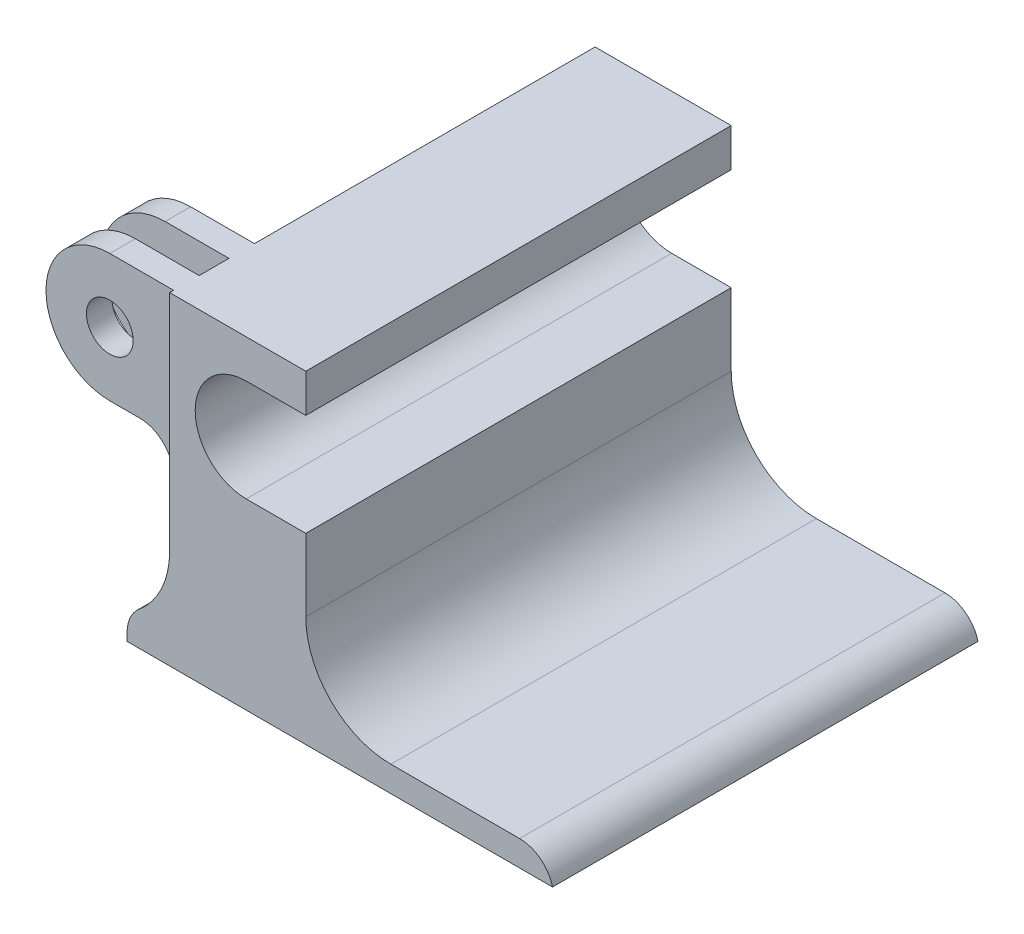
ISO-10303-21;
HEADER;
FILE_DESCRIPTION(('STEP AP214'),'2;1');
FILE_NAME('part.step','',(''),(''),'','','');
FILE_SCHEMA(('AUTOMOTIVE_DESIGN { 1 0 10303 214 1 1 1 1 }'));
ENDSEC;
DATA;
#1=APPLICATION_CONTEXT('core data for automotive mechanical design processes');
#2=APPLICATION_PROTOCOL_DEFINITION('international standard','automotive_design',2000,#1);
#3=PRODUCT_CONTEXT('',#1,'mechanical');
#4=PRODUCT('Part','Part','',(#3));
#5=PRODUCT_RELATED_PRODUCT_CATEGORY('part','',(#4));
#6=PRODUCT_DEFINITION_FORMATION('','',#4);
#7=PRODUCT_DEFINITION_CONTEXT('part definition',#1,'design');
#8=PRODUCT_DEFINITION('design','',#6,#7);
#9=PRODUCT_DEFINITION_SHAPE('','',#8);
#10=(LENGTH_UNIT() NAMED_UNIT(*) SI_UNIT(.MILLI.,.METRE.));
#11=(NAMED_UNIT(*) PLANE_ANGLE_UNIT() SI_UNIT($,.RADIAN.));
#12=(NAMED_UNIT(*) SI_UNIT($,.STERADIAN.) SOLID_ANGLE_UNIT());
#13=UNCERTAINTY_MEASURE_WITH_UNIT(LENGTH_MEASURE(1.E-05),#10,'distance_accuracy_value','');
#14=(GEOMETRIC_REPRESENTATION_CONTEXT(3) GLOBAL_UNCERTAINTY_ASSIGNED_CONTEXT((#13)) GLOBAL_UNIT_ASSIGNED_CONTEXT((#10,
#11,#12)) REPRESENTATION_CONTEXT('',''));
#15=CARTESIAN_POINT('',(0.,0.,0.));
#16=DIRECTION('',(0.,0.,1.));
#17=DIRECTION('',(1.,0.,0.));
#18=AXIS2_PLACEMENT_3D('',#15,#16,#17);
#19=CARTESIAN_POINT('',(-20.,38.,-24.780701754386));
#20=DIRECTION('',(1.,0.,0.));
#21=DIRECTION('',(0.,0.,-1.));
#22=AXIS2_PLACEMENT_3D('',#19,#20,#21);
#23=PLANE('',#22);
#24=DIRECTION('',(0.,-1.,0.));
#25=VECTOR('',#24,1.);
#26=CARTESIAN_POINT('',(-20.,38.,-24.780701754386));
#27=LINE('',#26,#25);
#28=CARTESIAN_POINT('',(-20.,38.,-24.780701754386));
#29=VERTEX_POINT('',#28);
#30=CARTESIAN_POINT('',(-20.,11.6602540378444,-24.780701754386));
#31=VERTEX_POINT('',#30);
#32=EDGE_CURVE('E247',#29,#31,#27,.T.);
#33=ORIENTED_EDGE('',*,*,#32,.T.);
#34=DIRECTION('',(0.,0.,-1.));
#35=VECTOR('',#34,1.);
#36=CARTESIAN_POINT('',(-20.,11.6602540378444,-24.780701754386));
#37=LINE('',#36,#35);
#38=CARTESIAN_POINT('',(-20.,11.6602540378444,25.2192982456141));
#39=VERTEX_POINT('',#38);
#40=EDGE_CURVE('E338',#31,#39,#37,.F.);
#41=ORIENTED_EDGE('',*,*,#40,.T.);
#42=DIRECTION('',(0.,-1.,0.));
#43=VECTOR('',#42,1.);
#44=CARTESIAN_POINT('',(-20.,38.,25.2192982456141));
#45=LINE('',#44,#43);
#46=CARTESIAN_POINT('',(-20.,38.,25.2192982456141));
#47=VERTEX_POINT('',#46);
#48=EDGE_CURVE('E257',#47,#39,#45,.T.);
#49=ORIENTED_EDGE('',*,*,#48,.F.);
#50=DIRECTION('',(0.,0.,1.));
#51=VECTOR('',#50,1.);
#52=CARTESIAN_POINT('',(-20.,38.,-24.780701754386));
#53=LINE('',#52,#51);
#54=CARTESIAN_POINT('',(-20.,38.,24.75));
#55=VERTEX_POINT('',#54);
#56=EDGE_CURVE('E233',#55,#47,#53,.T.);
#57=ORIENTED_EDGE('',*,*,#56,.F.);
#58=DIRECTION('',(0.,1.,0.));
#59=VECTOR('',#58,1.);
#60=CARTESIAN_POINT('',(-20.,38.,24.75));
#61=LINE('',#60,#59);
#62=CARTESIAN_POINT('',(-20.,19.,24.75));
#63=VERTEX_POINT('',#62);
#64=EDGE_CURVE('E216',#63,#55,#61,.T.);
#65=ORIENTED_EDGE('',*,*,#64,.F.);
#66=DIRECTION('',(0.,0.,1.));
#67=VECTOR('',#66,1.);
#68=CARTESIAN_POINT('',(-20.,19.,21.75));
#69=LINE('',#68,#67);
#70=CARTESIAN_POINT('',(-20.,19.,21.75));
#71=VERTEX_POINT('',#70);
#72=EDGE_CURVE('E223',#63,#71,#69,.F.);
#73=ORIENTED_EDGE('',*,*,#72,.T.);
#74=DIRECTION('',(0.,-1.,0.));
#75=VECTOR('',#74,1.);
#76=CARTESIAN_POINT('',(-20.,38.,21.75));
#77=LINE('',#76,#75);
#78=CARTESIAN_POINT('',(-20.,38.,21.75));
#79=VERTEX_POINT('',#78);
#80=EDGE_CURVE('E208',#79,#71,#77,.T.);
#81=ORIENTED_EDGE('',*,*,#80,.F.);
#82=CARTESIAN_POINT('',(-20.,38.,18.25));
#83=VERTEX_POINT('',#82);
#84=EDGE_CURVE('E221',#83,#79,#53,.T.);
#85=ORIENTED_EDGE('',*,*,#84,.F.);
#86=DIRECTION('',(0.,1.,0.));
#87=VECTOR('',#86,1.);
#88=CARTESIAN_POINT('',(-20.,38.,18.25));
#89=LINE('',#88,#87);
#90=CARTESIAN_POINT('',(-20.,19.,18.25));
#91=VERTEX_POINT('',#90);
#92=EDGE_CURVE('E514',#91,#83,#89,.T.);
#93=ORIENTED_EDGE('',*,*,#92,.F.);
#94=DIRECTION('',(0.,0.,1.));
#95=VECTOR('',#94,1.);
#96=CARTESIAN_POINT('',(-20.,19.,15.25));
#97=LINE('',#96,#95);
#98=CARTESIAN_POINT('',(-20.,19.,15.25));
#99=VERTEX_POINT('',#98);
#100=EDGE_CURVE('E311',#91,#99,#97,.F.);
#101=ORIENTED_EDGE('',*,*,#100,.T.);
#102=DIRECTION('',(0.,-1.,0.));
#103=VECTOR('',#102,1.);
#104=CARTESIAN_POINT('',(-20.,38.,15.25));
#105=LINE('',#104,#103);
#106=CARTESIAN_POINT('',(-20.,38.,15.25));
#107=VERTEX_POINT('',#106);
#108=EDGE_CURVE('E512',#107,#99,#105,.T.);
#109=ORIENTED_EDGE('',*,*,#108,.F.);
#110=EDGE_CURVE('E232',#29,#107,#53,.T.);
#111=ORIENTED_EDGE('',*,*,#110,.F.);
#112=EDGE_LOOP('',(#33,#41,#49,#57,#65,#73,#81,#85,#93,#101,#109,#111));
#113=FACE_BOUND('',#112,.T.);
#114=ADVANCED_FACE('F33',(#113),#23,.F.);
#115=CARTESIAN_POINT('',(-4.,38.,-24.780701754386));
#116=DIRECTION('',(-1.,0.,0.));
#117=DIRECTION('',(0.,0.,1.));
#118=AXIS2_PLACEMENT_3D('',#115,#116,#117);
#119=PLANE('',#118);
#120=DIRECTION('',(0.,-1.,0.));
#121=VECTOR('',#120,1.);
#122=CARTESIAN_POINT('',(-3.99999999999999,38.,25.2192982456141));
#123=LINE('',#122,#121);
#124=CARTESIAN_POINT('',(-3.99999999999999,38.,25.2192982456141));
#125=VERTEX_POINT('',#124);
#126=CARTESIAN_POINT('',(-3.99999999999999,33.5,25.2192982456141));
#127=VERTEX_POINT('',#126);
#128=EDGE_CURVE('E254',#125,#127,#123,.T.);
#129=ORIENTED_EDGE('',*,*,#128,.T.);
#130=DIRECTION('',(0.,0.,-1.));
#131=VECTOR('',#130,1.);
#132=CARTESIAN_POINT('',(-4.,33.5,-24.780701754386));
#133=LINE('',#132,#131);
#134=CARTESIAN_POINT('',(-4.,33.5,-24.780701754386));
#135=VERTEX_POINT('',#134);
#136=EDGE_CURVE('E405',#127,#135,#133,.T.);
#137=ORIENTED_EDGE('',*,*,#136,.T.);
#138=DIRECTION('',(0.,-1.,0.));
#139=VECTOR('',#138,1.);
#140=CARTESIAN_POINT('',(-4.,38.,-24.780701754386));
#141=LINE('',#140,#139);
#142=CARTESIAN_POINT('',(-4.,38.,-24.780701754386));
#143=VERTEX_POINT('',#142);
#144=EDGE_CURVE('E250',#143,#135,#141,.T.);
#145=ORIENTED_EDGE('',*,*,#144,.F.);
#146=DIRECTION('',(0.,0.,-1.));
#147=VECTOR('',#146,1.);
#148=CARTESIAN_POINT('',(-4.,38.,-24.780701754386));
#149=LINE('',#148,#147);
#150=EDGE_CURVE('E243',#125,#143,#149,.T.);
#151=ORIENTED_EDGE('',*,*,#150,.F.);
#152=EDGE_LOOP('',(#129,#137,#145,#151));
#153=FACE_BOUND('',#152,.T.);
#154=ADVANCED_FACE('F429',(#153),#119,.F.);
#155=CARTESIAN_POINT('',(-25.,3.,-24.7807017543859));
#156=DIRECTION('',(1.,0.,0.));
#157=DIRECTION('',(0.,0.,-1.));
#158=AXIS2_PLACEMENT_3D('',#155,#156,#157);
#159=PLANE('',#158);
#160=DIRECTION('',(0.,-1.,0.));
#161=VECTOR('',#160,1.);
#162=CARTESIAN_POINT('',(-25.,3.,25.2192982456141));
#163=LINE('',#162,#161);
#164=CARTESIAN_POINT('',(-25.,0.936448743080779,25.2192982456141));
#165=VERTEX_POINT('',#164);
#166=CARTESIAN_POINT('',(-25.,0.,25.2192982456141));
#167=VERTEX_POINT('',#166);
#168=EDGE_CURVE('E276',#165,#167,#163,.T.);
#169=ORIENTED_EDGE('',*,*,#168,.F.);
#170=DIRECTION('',(0.,0.,-1.));
#171=VECTOR('',#170,1.);
#172=CARTESIAN_POINT('',(-25.,0.936448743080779,-24.7807017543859));
#173=LINE('',#172,#171);
#174=CARTESIAN_POINT('',(-25.,0.936448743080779,-24.7807017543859));
#175=VERTEX_POINT('',#174);
#176=EDGE_CURVE('E351',#165,#175,#173,.T.);
#177=ORIENTED_EDGE('',*,*,#176,.T.);
#178=DIRECTION('',(0.,-1.,0.));
#179=VECTOR('',#178,1.);
#180=CARTESIAN_POINT('',(-25.,3.,-24.7807017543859));
#181=LINE('',#180,#179);
#182=CARTESIAN_POINT('',(-25.,0.,-24.7807017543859));
#183=VERTEX_POINT('',#182);
#184=EDGE_CURVE('E266',#175,#183,#181,.T.);
#185=ORIENTED_EDGE('',*,*,#184,.T.);
#186=DIRECTION('',(0.,0.,1.));
#187=VECTOR('',#186,1.);
#188=CARTESIAN_POINT('',(-25.,0.,-24.7807017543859));
#189=LINE('',#188,#187);
#190=EDGE_CURVE('E260',#183,#167,#189,.T.);
#191=ORIENTED_EDGE('',*,*,#190,.T.);
#192=EDGE_LOOP('',(#169,#177,#185,#191));
#193=FACE_BOUND('',#192,.T.);
#194=ADVANCED_FACE('F434',(#193),#159,.F.);
#195=CARTESIAN_POINT('',(-25.,3.,25.2192982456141));
#196=DIRECTION('',(0.,0.,-1.));
#197=DIRECTION('',(-1.,0.,0.));
#198=AXIS2_PLACEMENT_3D('',#195,#196,#197);
#199=PLANE('',#198);
#200=DIRECTION('',(1.,0.,0.));
#201=VECTOR('',#200,1.);
#202=CARTESIAN_POINT('',(-25.,0.,25.2192982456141));
#203=LINE('',#202,#201);
#204=CARTESIAN_POINT('',(25.,0.,25.219298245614));
#205=VERTEX_POINT('',#204);
#206=EDGE_CURVE('E269',#167,#205,#203,.T.);
#207=ORIENTED_EDGE('',*,*,#206,.T.);
#208=CARTESIAN_POINT('',(21.1270166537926,-1.,25.219298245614));
#209=DIRECTION('',(0.,0.,-1.));
#210=DIRECTION('',(-1.,0.,0.));
#211=AXIS2_PLACEMENT_3D('',#208,#209,#210);
#212=CIRCLE('',#211,4.);
#213=CARTESIAN_POINT('',(21.1270166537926,3.,25.219298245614));
#214=VERTEX_POINT('',#213);
#215=EDGE_CURVE('E11',#205,#214,#212,.F.);
#216=ORIENTED_EDGE('',*,*,#215,.T.);
#217=DIRECTION('',(1.,0.,0.));
#218=VECTOR('',#217,1.);
#219=CARTESIAN_POINT('',(-25.,3.,25.2192982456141));
#220=LINE('',#219,#218);
#221=CARTESIAN_POINT('',(6.,3.,25.2192982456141));
#222=VERTEX_POINT('',#221);
#223=EDGE_CURVE('E261',#222,#214,#220,.T.);
#224=ORIENTED_EDGE('',*,*,#223,.F.);
#225=CARTESIAN_POINT('',(6.00000000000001,13.,25.219298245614));
#226=DIRECTION('',(0.,0.,-1.));
#227=DIRECTION('',(-1.,0.,0.));
#228=AXIS2_PLACEMENT_3D('',#225,#226,#227);
#229=CIRCLE('',#228,10.);
#230=CARTESIAN_POINT('',(-3.99999999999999,13.,25.2192982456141));
#231=VERTEX_POINT('',#230);
#232=EDGE_CURVE('E336',#222,#231,#229,.T.);
#233=ORIENTED_EDGE('',*,*,#232,.T.);
#234=CARTESIAN_POINT('',(-3.99999999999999,21.5,25.2192982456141));
#235=VERTEX_POINT('',#234);
#236=EDGE_CURVE('E253',#235,#231,#123,.T.);
#237=ORIENTED_EDGE('',*,*,#236,.F.);
#238=DIRECTION('',(1.,0.,0.));
#239=VECTOR('',#238,1.);
#240=CARTESIAN_POINT('',(-11.,21.5,25.2192982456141));
#241=LINE('',#240,#239);
#242=CARTESIAN_POINT('',(-11.,21.5,25.2192982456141));
#243=VERTEX_POINT('',#242);
#244=EDGE_CURVE('E394',#243,#235,#241,.T.);
#245=ORIENTED_EDGE('',*,*,#244,.F.);
#246=CARTESIAN_POINT('',(-11.,27.5,25.2192982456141));
#247=DIRECTION('',(0.,0.,1.));
#248=DIRECTION('',(1.,0.,0.));
#249=AXIS2_PLACEMENT_3D('',#246,#247,#248);
#250=CIRCLE('',#249,6.);
#251=CARTESIAN_POINT('',(-11.,33.5,25.2192982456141));
#252=VERTEX_POINT('',#251);
#253=EDGE_CURVE('E240',#252,#243,#250,.T.);
#254=ORIENTED_EDGE('',*,*,#253,.F.);
#255=DIRECTION('',(-1.,0.,0.));
#256=VECTOR('',#255,1.);
#257=CARTESIAN_POINT('',(0.,33.5,25.2192982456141));
#258=LINE('',#257,#256);
#259=EDGE_CURVE('E398',#127,#252,#258,.T.);
#260=ORIENTED_EDGE('',*,*,#259,.F.);
#261=ORIENTED_EDGE('',*,*,#128,.F.);
#262=DIRECTION('',(1.,0.,0.));
#263=VECTOR('',#262,1.);
#264=CARTESIAN_POINT('',(-20.,38.,25.2192982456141));
#265=LINE('',#264,#263);
#266=EDGE_CURVE('E236',#47,#125,#265,.T.);
#267=ORIENTED_EDGE('',*,*,#266,.F.);
#268=ORIENTED_EDGE('',*,*,#48,.T.);
#269=CARTESIAN_POINT('',(-30.,11.6602540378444,25.2192982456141));
#270=DIRECTION('',(0.,0.,-1.));
#271=DIRECTION('',(-1.,0.,0.));
#272=AXIS2_PLACEMENT_3D('',#269,#270,#271);
#273=CIRCLE('',#272,10.);
#274=CARTESIAN_POINT('',(-23.5714285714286,4.00039311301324,25.2192982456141));
#275=VERTEX_POINT('',#274);
#276=EDGE_CURVE('E341',#39,#275,#273,.T.);
#277=ORIENTED_EDGE('',*,*,#276,.T.);
#278=CARTESIAN_POINT('',(-21.,0.936448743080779,25.2192982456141));
#279=DIRECTION('',(0.,0.,-1.));
#280=DIRECTION('',(-1.,0.,0.));
#281=AXIS2_PLACEMENT_3D('',#278,#279,#280);
#282=CIRCLE('',#281,4.);
#283=EDGE_CURVE('E349',#275,#165,#282,.F.);
#284=ORIENTED_EDGE('',*,*,#283,.T.);
#285=ORIENTED_EDGE('',*,*,#168,.T.);
#286=EDGE_LOOP('',(#207,#216,#224,#233,#237,#245,#254,#260,#261,#267,#268,#277,#284,#285));
#287=FACE_BOUND('',#286,.T.);
#288=ADVANCED_FACE('F370',(#287),#199,.F.);
#289=CARTESIAN_POINT('',(-25.,3.,-24.7807017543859));
#290=DIRECTION('',(0.,0.,1.));
#291=DIRECTION('',(1.,0.,0.));
#292=AXIS2_PLACEMENT_3D('',#289,#290,#291);
#293=PLANE('',#292);
#294=DIRECTION('',(-1.,0.,0.));
#295=VECTOR('',#294,1.);
#296=CARTESIAN_POINT('',(-25.,3.,-24.7807017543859));
#297=LINE('',#296,#295);
#298=CARTESIAN_POINT('',(21.1270166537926,3.,-24.780701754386));
#299=VERTEX_POINT('',#298);
#300=CARTESIAN_POINT('',(6.,3.,-24.780701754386));
#301=VERTEX_POINT('',#300);
#302=EDGE_CURVE('E263',#299,#301,#297,.T.);
#303=ORIENTED_EDGE('',*,*,#302,.F.);
#304=CARTESIAN_POINT('',(21.1270166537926,-1.,-24.780701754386));
#305=DIRECTION('',(0.,0.,1.));
#306=DIRECTION('',(1.,0.,0.));
#307=AXIS2_PLACEMENT_3D('',#304,#305,#306);
#308=CIRCLE('',#307,4.);
#309=CARTESIAN_POINT('',(25.,0.,-24.780701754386));
#310=VERTEX_POINT('',#309);
#311=EDGE_CURVE('E41',#299,#310,#308,.F.);
#312=ORIENTED_EDGE('',*,*,#311,.T.);
#313=DIRECTION('',(-1.,0.,0.));
#314=VECTOR('',#313,1.);
#315=CARTESIAN_POINT('',(-25.,0.,-24.7807017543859));
#316=LINE('',#315,#314);
#317=EDGE_CURVE('E264',#310,#183,#316,.T.);
#318=ORIENTED_EDGE('',*,*,#317,.T.);
#319=ORIENTED_EDGE('',*,*,#184,.F.);
#320=CARTESIAN_POINT('',(-21.,0.936448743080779,-24.7807017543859));
#321=DIRECTION('',(0.,0.,1.));
#322=DIRECTION('',(1.,0.,0.));
#323=AXIS2_PLACEMENT_3D('',#320,#321,#322);
#324=CIRCLE('',#323,4.);
#325=CARTESIAN_POINT('',(-23.5714285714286,4.00039311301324,-24.7807017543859));
#326=VERTEX_POINT('',#325);
#327=EDGE_CURVE('E353',#175,#326,#324,.F.);
#328=ORIENTED_EDGE('',*,*,#327,.T.);
#329=CARTESIAN_POINT('',(-30.,11.6602540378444,-24.7807017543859));
#330=DIRECTION('',(0.,0.,1.));
#331=DIRECTION('',(1.,0.,0.));
#332=AXIS2_PLACEMENT_3D('',#329,#330,#331);
#333=CIRCLE('',#332,10.);
#334=EDGE_CURVE('E344',#326,#31,#333,.T.);
#335=ORIENTED_EDGE('',*,*,#334,.T.);
#336=ORIENTED_EDGE('',*,*,#32,.F.);
#337=DIRECTION('',(-1.,0.,0.));
#338=VECTOR('',#337,1.);
#339=CARTESIAN_POINT('',(-20.,38.,-24.780701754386));
#340=LINE('',#339,#338);
#341=EDGE_CURVE('E245',#143,#29,#340,.T.);
#342=ORIENTED_EDGE('',*,*,#341,.F.);
#343=ORIENTED_EDGE('',*,*,#144,.T.);
#344=DIRECTION('',(-1.,0.,0.));
#345=VECTOR('',#344,1.);
#346=CARTESIAN_POINT('',(0.,33.5,-24.780701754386));
#347=LINE('',#346,#345);
#348=CARTESIAN_POINT('',(-11.,33.5,-24.780701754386));
#349=VERTEX_POINT('',#348);
#350=EDGE_CURVE('E389',#135,#349,#347,.T.);
#351=ORIENTED_EDGE('',*,*,#350,.T.);
#352=CARTESIAN_POINT('',(-11.,27.5,-24.780701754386));
#353=DIRECTION('',(0.,0.,1.));
#354=DIRECTION('',(1.,0.,0.));
#355=AXIS2_PLACEMENT_3D('',#352,#353,#354);
#356=CIRCLE('',#355,6.);
#357=CARTESIAN_POINT('',(-11.,21.5,-24.780701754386));
#358=VERTEX_POINT('',#357);
#359=EDGE_CURVE('E237',#349,#358,#356,.T.);
#360=ORIENTED_EDGE('',*,*,#359,.T.);
#361=DIRECTION('',(1.,0.,0.));
#362=VECTOR('',#361,1.);
#363=CARTESIAN_POINT('',(-11.,21.5,-24.780701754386));
#364=LINE('',#363,#362);
#365=CARTESIAN_POINT('',(-4.,21.5,-24.780701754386));
#366=VERTEX_POINT('',#365);
#367=EDGE_CURVE('E383',#358,#366,#364,.T.);
#368=ORIENTED_EDGE('',*,*,#367,.T.);
#369=CARTESIAN_POINT('',(-4.,13.,-24.780701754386));
#370=VERTEX_POINT('',#369);
#371=EDGE_CURVE('E249',#366,#370,#141,.T.);
#372=ORIENTED_EDGE('',*,*,#371,.T.);
#373=CARTESIAN_POINT('',(6.,13.,-24.780701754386));
#374=DIRECTION('',(0.,0.,1.));
#375=DIRECTION('',(1.,0.,0.));
#376=AXIS2_PLACEMENT_3D('',#373,#374,#375);
#377=CIRCLE('',#376,10.);
#378=EDGE_CURVE('E333',#370,#301,#377,.T.);
#379=ORIENTED_EDGE('',*,*,#378,.T.);
#380=EDGE_LOOP('',(#303,#312,#318,#319,#328,#335,#336,#342,#343,#351,#360,#368,#372,#379));
#381=FACE_BOUND('',#380,.T.);
#382=ADVANCED_FACE('F359',(#381),#293,.F.);
#383=CARTESIAN_POINT('',(0.,3.,0.));
#384=DIRECTION('',(0.,1.,0.));
#385=DIRECTION('',(0.,0.,1.));
#386=AXIS2_PLACEMENT_3D('',#383,#384,#385);
#387=PLANE('',#386);
#388=ORIENTED_EDGE('',*,*,#223,.T.);
#389=DIRECTION('',(0.,0.,1.));
#390=VECTOR('',#389,1.);
#391=CARTESIAN_POINT('',(21.1270166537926,3.,-24.780701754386));
#392=LINE('',#391,#390);
#393=EDGE_CURVE('E355',#214,#299,#392,.F.);
#394=ORIENTED_EDGE('',*,*,#393,.T.);
#395=ORIENTED_EDGE('',*,*,#302,.T.);
#396=DIRECTION('',(0.,0.,-1.));
#397=VECTOR('',#396,1.);
#398=CARTESIAN_POINT('',(6.,3.,0.));
#399=LINE('',#398,#397);
#400=EDGE_CURVE('E331',#301,#222,#399,.F.);
#401=ORIENTED_EDGE('',*,*,#400,.T.);
#402=EDGE_LOOP('',(#388,#394,#395,#401));
#403=FACE_BOUND('',#402,.T.);
#404=ADVANCED_FACE('F367',(#403),#387,.T.);
#405=CARTESIAN_POINT('',(0.,0.,0.));
#406=DIRECTION('',(0.,1.,0.));
#407=DIRECTION('',(0.,0.,1.));
#408=AXIS2_PLACEMENT_3D('',#405,#406,#407);
#409=PLANE('',#408);
#410=ORIENTED_EDGE('',*,*,#190,.F.);
#411=ORIENTED_EDGE('',*,*,#317,.F.);
#412=DIRECTION('',(0.,0.,-1.));
#413=VECTOR('',#412,1.);
#414=CARTESIAN_POINT('',(25.,0.,-24.780701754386));
#415=LINE('',#414,#413);
#416=EDGE_CURVE('E271',#205,#310,#415,.T.);
#417=ORIENTED_EDGE('',*,*,#416,.F.);
#418=ORIENTED_EDGE('',*,*,#206,.F.);
#419=EDGE_LOOP('',(#410,#411,#417,#418));
#420=FACE_BOUND('',#419,.T.);
#421=ADVANCED_FACE('F364',(#420),#409,.F.);
#422=ORIENTED_EDGE('',*,*,#236,.T.);
#423=DIRECTION('',(0.,0.,-1.));
#424=VECTOR('',#423,1.);
#425=CARTESIAN_POINT('',(-4.,13.,-24.780701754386));
#426=LINE('',#425,#424);
#427=EDGE_CURVE('E328',#231,#370,#426,.T.);
#428=ORIENTED_EDGE('',*,*,#427,.T.);
#429=ORIENTED_EDGE('',*,*,#371,.F.);
#430=DIRECTION('',(0.,0.,1.));
#431=VECTOR('',#430,1.);
#432=CARTESIAN_POINT('',(-4.,21.5,-24.780701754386));
#433=LINE('',#432,#431);
#434=EDGE_CURVE('E402',#366,#235,#433,.T.);
#435=ORIENTED_EDGE('',*,*,#434,.T.);
#436=EDGE_LOOP('',(#422,#428,#429,#435));
#437=FACE_BOUND('',#436,.T.);
#438=ADVANCED_FACE('F379',(#437),#119,.F.);
#439=CARTESIAN_POINT('',(0.,38.,0.));
#440=DIRECTION('',(0.,1.,0.));
#441=DIRECTION('',(0.,0.,1.));
#442=AXIS2_PLACEMENT_3D('',#439,#440,#441);
#443=PLANE('',#442);
#444=DIRECTION('',(1.,0.,0.));
#445=VECTOR('',#444,1.);
#446=CARTESIAN_POINT('',(-35.,38.,21.75));
#447=LINE('',#446,#445);
#448=CARTESIAN_POINT('',(-27.5,38.,21.75));
#449=VERTEX_POINT('',#448);
#450=EDGE_CURVE('E204',#449,#79,#447,.T.);
#451=ORIENTED_EDGE('',*,*,#450,.F.);
#452=DIRECTION('',(0.,0.,-1.));
#453=VECTOR('',#452,1.);
#454=CARTESIAN_POINT('',(-27.5,38.,0.));
#455=LINE('',#454,#453);
#456=CARTESIAN_POINT('',(-27.5,38.,24.75));
#457=VERTEX_POINT('',#456);
#458=EDGE_CURVE('E290',#449,#457,#455,.F.);
#459=ORIENTED_EDGE('',*,*,#458,.T.);
#460=DIRECTION('',(1.,0.,0.));
#461=VECTOR('',#460,1.);
#462=CARTESIAN_POINT('',(-35.,38.,24.75));
#463=LINE('',#462,#461);
#464=EDGE_CURVE('E215',#457,#55,#463,.T.);
#465=ORIENTED_EDGE('',*,*,#464,.T.);
#466=ORIENTED_EDGE('',*,*,#56,.T.);
#467=ORIENTED_EDGE('',*,*,#266,.T.);
#468=ORIENTED_EDGE('',*,*,#150,.T.);
#469=ORIENTED_EDGE('',*,*,#341,.T.);
#470=ORIENTED_EDGE('',*,*,#110,.T.);
#471=DIRECTION('',(1.,0.,0.));
#472=VECTOR('',#471,1.);
#473=CARTESIAN_POINT('',(-35.,38.,15.25));
#474=LINE('',#473,#472);
#475=CARTESIAN_POINT('',(-27.5,38.,15.25));
#476=VERTEX_POINT('',#475);
#477=EDGE_CURVE('E520',#476,#107,#474,.T.);
#478=ORIENTED_EDGE('',*,*,#477,.F.);
#479=DIRECTION('',(0.,0.,-1.));
#480=VECTOR('',#479,1.);
#481=CARTESIAN_POINT('',(-27.5,38.,0.));
#482=LINE('',#481,#480);
#483=CARTESIAN_POINT('',(-27.5,38.,18.25));
#484=VERTEX_POINT('',#483);
#485=EDGE_CURVE('E288',#476,#484,#482,.F.);
#486=ORIENTED_EDGE('',*,*,#485,.T.);
#487=DIRECTION('',(1.,0.,0.));
#488=VECTOR('',#487,1.);
#489=CARTESIAN_POINT('',(-35.,38.,18.25));
#490=LINE('',#489,#488);
#491=EDGE_CURVE('E230',#484,#83,#490,.T.);
#492=ORIENTED_EDGE('',*,*,#491,.T.);
#493=ORIENTED_EDGE('',*,*,#84,.T.);
#494=EDGE_LOOP('',(#451,#459,#465,#466,#467,#468,#469,#470,#478,#486,#492,#493));
#495=FACE_BOUND('',#494,.T.);
#496=ADVANCED_FACE('F227',(#495),#443,.T.);
#497=CARTESIAN_POINT('',(-11.,27.5,-24.780701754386));
#498=DIRECTION('',(0.,0.,1.));
#499=DIRECTION('',(1.,0.,0.));
#500=AXIS2_PLACEMENT_3D('',#497,#498,#499);
#501=CYLINDRICAL_SURFACE('',#500,6.);
#502=ORIENTED_EDGE('',*,*,#253,.T.);
#503=DIRECTION('',(0.,0.,1.));
#504=VECTOR('',#503,1.);
#505=CARTESIAN_POINT('',(-11.,21.5,-24.780701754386));
#506=LINE('',#505,#504);
#507=EDGE_CURVE('E392',#358,#243,#506,.T.);
#508=ORIENTED_EDGE('',*,*,#507,.F.);
#509=ORIENTED_EDGE('',*,*,#359,.F.);
#510=DIRECTION('',(0.,0.,1.));
#511=VECTOR('',#510,1.);
#512=CARTESIAN_POINT('',(-11.,33.5,-24.780701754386));
#513=LINE('',#512,#511);
#514=EDGE_CURVE('E388',#349,#252,#513,.T.);
#515=ORIENTED_EDGE('',*,*,#514,.T.);
#516=EDGE_LOOP('',(#502,#508,#509,#515));
#517=FACE_BOUND('',#516,.T.);
#518=ADVANCED_FACE('F410',(#517),#501,.F.);
#519=CARTESIAN_POINT('',(0.,33.5,-24.780701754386));
#520=DIRECTION('',(0.,1.,0.));
#521=DIRECTION('',(0.,0.,1.));
#522=AXIS2_PLACEMENT_3D('',#519,#520,#521);
#523=PLANE('',#522);
#524=ORIENTED_EDGE('',*,*,#259,.T.);
#525=ORIENTED_EDGE('',*,*,#514,.F.);
#526=ORIENTED_EDGE('',*,*,#350,.F.);
#527=ORIENTED_EDGE('',*,*,#136,.F.);
#528=EDGE_LOOP('',(#524,#525,#526,#527));
#529=FACE_BOUND('',#528,.T.);
#530=ADVANCED_FACE('F417',(#529),#523,.F.);
#531=CARTESIAN_POINT('',(-11.,21.5,-24.780701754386));
#532=DIRECTION('',(0.,-1.,0.));
#533=DIRECTION('',(0.,0.,-1.));
#534=AXIS2_PLACEMENT_3D('',#531,#532,#533);
#535=PLANE('',#534);
#536=ORIENTED_EDGE('',*,*,#367,.F.);
#537=ORIENTED_EDGE('',*,*,#507,.T.);
#538=ORIENTED_EDGE('',*,*,#244,.T.);
#539=ORIENTED_EDGE('',*,*,#434,.F.);
#540=EDGE_LOOP('',(#536,#537,#538,#539));
#541=FACE_BOUND('',#540,.T.);
#542=ADVANCED_FACE('F414',(#541),#535,.F.);
#543=CARTESIAN_POINT('',(-35.,38.,15.25));
#544=DIRECTION('',(0.,0.,1.));
#545=DIRECTION('',(1.,0.,0.));
#546=AXIS2_PLACEMENT_3D('',#543,#544,#545);
#547=PLANE('',#546);
#548=CARTESIAN_POINT('',(-27.5,30.5,15.25));
#549=DIRECTION('',(0.,0.,1.));
#550=DIRECTION('',(1.,0.,0.));
#551=AXIS2_PLACEMENT_3D('',#548,#549,#550);
#552=CIRCLE('',#551,2.75);
#553=CARTESIAN_POINT('',(-24.75,30.5,15.25));
#554=VERTEX_POINT('',#553);
#555=EDGE_CURVE('E308',#554,#554,#552,.T.);
#556=ORIENTED_EDGE('',*,*,#555,.T.);
#557=EDGE_LOOP('',(#556));
#558=FACE_BOUND('',#557,.T.);
#559=CARTESIAN_POINT('',(-27.5,30.5,15.25));
#560=DIRECTION('',(0.,0.,1.));
#561=DIRECTION('',(1.,0.,0.));
#562=AXIS2_PLACEMENT_3D('',#559,#560,#561);
#563=CIRCLE('',#562,7.5);
#564=CARTESIAN_POINT('',(-27.5,23.,15.25));
#565=VERTEX_POINT('',#564);
#566=CARTESIAN_POINT('',(-35.,30.5,15.25));
#567=VERTEX_POINT('',#566);
#568=EDGE_CURVE('E292',#565,#567,#563,.F.);
#569=ORIENTED_EDGE('',*,*,#568,.T.);
#570=CARTESIAN_POINT('',(-27.5,30.5,15.25));
#571=DIRECTION('',(0.,0.,1.));
#572=DIRECTION('',(1.,0.,0.));
#573=AXIS2_PLACEMENT_3D('',#570,#571,#572);
#574=CIRCLE('',#573,7.5);
#575=EDGE_CURVE('E294',#567,#476,#574,.F.);
#576=ORIENTED_EDGE('',*,*,#575,.T.);
#577=ORIENTED_EDGE('',*,*,#477,.T.);
#578=ORIENTED_EDGE('',*,*,#108,.T.);
#579=CARTESIAN_POINT('',(-24.,19.,15.25));
#580=DIRECTION('',(0.,0.,1.));
#581=DIRECTION('',(1.,0.,0.));
#582=AXIS2_PLACEMENT_3D('',#579,#580,#581);
#583=CIRCLE('',#582,4.);
#584=CARTESIAN_POINT('',(-24.,23.,15.25));
#585=VERTEX_POINT('',#584);
#586=EDGE_CURVE('E326',#99,#585,#583,.T.);
#587=ORIENTED_EDGE('',*,*,#586,.T.);
#588=DIRECTION('',(1.,0.,0.));
#589=VECTOR('',#588,1.);
#590=CARTESIAN_POINT('',(-35.,23.,15.25));
#591=LINE('',#590,#589);
#592=EDGE_CURVE('E400',#565,#585,#591,.T.);
#593=ORIENTED_EDGE('',*,*,#592,.F.);
#594=EDGE_LOOP('',(#569,#576,#577,#578,#587,#593));
#595=FACE_BOUND('',#594,.T.);
#596=ADVANCED_FACE('F416',(#558,#595),#547,.F.);
#597=CARTESIAN_POINT('',(-35.,23.,15.25));
#598=DIRECTION('',(0.,1.,0.));
#599=DIRECTION('',(0.,0.,1.));
#600=AXIS2_PLACEMENT_3D('',#597,#598,#599);
#601=PLANE('',#600);
#602=ORIENTED_EDGE('',*,*,#592,.T.);
#603=DIRECTION('',(0.,0.,1.));
#604=VECTOR('',#603,1.);
#605=CARTESIAN_POINT('',(-24.,23.,18.25));
#606=LINE('',#605,#604);
#607=CARTESIAN_POINT('',(-24.,23.,18.25));
#608=VERTEX_POINT('',#607);
#609=EDGE_CURVE('E315',#585,#608,#606,.T.);
#610=ORIENTED_EDGE('',*,*,#609,.T.);
#611=DIRECTION('',(1.,0.,0.));
#612=VECTOR('',#611,1.);
#613=CARTESIAN_POINT('',(-35.,23.,18.25));
#614=LINE('',#613,#612);
#615=CARTESIAN_POINT('',(-27.5,23.,18.25));
#616=VERTEX_POINT('',#615);
#617=EDGE_CURVE('E523',#616,#608,#614,.T.);
#618=ORIENTED_EDGE('',*,*,#617,.F.);
#619=DIRECTION('',(0.,0.,1.));
#620=VECTOR('',#619,1.);
#621=CARTESIAN_POINT('',(-27.5,23.,15.25));
#622=LINE('',#621,#620);
#623=EDGE_CURVE('E300',#616,#565,#622,.F.);
#624=ORIENTED_EDGE('',*,*,#623,.T.);
#625=EDGE_LOOP('',(#602,#610,#618,#624));
#626=FACE_BOUND('',#625,.T.);
#627=ADVANCED_FACE('F423',(#626),#601,.F.);
#628=CARTESIAN_POINT('',(-35.,38.,18.25));
#629=DIRECTION('',(0.,0.,-1.));
#630=DIRECTION('',(-1.,0.,0.));
#631=AXIS2_PLACEMENT_3D('',#628,#629,#630);
#632=PLANE('',#631);
#633=CARTESIAN_POINT('',(-27.5,30.5,18.25));
#634=DIRECTION('',(0.,0.,-1.));
#635=DIRECTION('',(-1.,0.,0.));
#636=AXIS2_PLACEMENT_3D('',#633,#634,#635);
#637=CIRCLE('',#636,2.75);
#638=CARTESIAN_POINT('',(-30.25,30.5,18.25));
#639=VERTEX_POINT('',#638);
#640=EDGE_CURVE('E570',#639,#639,#637,.T.);
#641=ORIENTED_EDGE('',*,*,#640,.T.);
#642=EDGE_LOOP('',(#641));
#643=FACE_BOUND('',#642,.T.);
#644=ORIENTED_EDGE('',*,*,#491,.F.);
#645=CARTESIAN_POINT('',(-27.5,30.5,18.25));
#646=DIRECTION('',(0.,0.,-1.));
#647=DIRECTION('',(-1.,0.,0.));
#648=AXIS2_PLACEMENT_3D('',#645,#646,#647);
#649=CIRCLE('',#648,7.5);
#650=CARTESIAN_POINT('',(-35.,30.5,18.25));
#651=VERTEX_POINT('',#650);
#652=EDGE_CURVE('E298',#484,#651,#649,.F.);
#653=ORIENTED_EDGE('',*,*,#652,.T.);
#654=CARTESIAN_POINT('',(-27.5,30.5,18.25));
#655=DIRECTION('',(0.,0.,-1.));
#656=DIRECTION('',(-1.,0.,0.));
#657=AXIS2_PLACEMENT_3D('',#654,#655,#656);
#658=CIRCLE('',#657,7.5);
#659=EDGE_CURVE('E296',#651,#616,#658,.F.);
#660=ORIENTED_EDGE('',*,*,#659,.T.);
#661=ORIENTED_EDGE('',*,*,#617,.T.);
#662=CARTESIAN_POINT('',(-24.,19.,18.25));
#663=DIRECTION('',(0.,0.,-1.));
#664=DIRECTION('',(-1.,0.,0.));
#665=AXIS2_PLACEMENT_3D('',#662,#663,#664);
#666=CIRCLE('',#665,4.);
#667=EDGE_CURVE('E323',#608,#91,#666,.T.);
#668=ORIENTED_EDGE('',*,*,#667,.T.);
#669=ORIENTED_EDGE('',*,*,#92,.T.);
#670=EDGE_LOOP('',(#644,#653,#660,#661,#668,#669));
#671=FACE_BOUND('',#670,.T.);
#672=ADVANCED_FACE('F536',(#643,#671),#632,.F.);
#673=CARTESIAN_POINT('',(-35.,38.,21.75));
#674=DIRECTION('',(0.,0.,1.));
#675=DIRECTION('',(0.,-1.,0.));
#676=AXIS2_PLACEMENT_3D('',#673,#674,#675);
#677=PLANE('',#676);
#678=CARTESIAN_POINT('',(-27.5,30.5,21.75));
#679=DIRECTION('',(0.,0.,1.));
#680=DIRECTION('',(0.,-1.,0.));
#681=AXIS2_PLACEMENT_3D('',#678,#679,#680);
#682=CIRCLE('',#681,2.75);
#683=CARTESIAN_POINT('',(-27.5,27.75,21.75));
#684=VERTEX_POINT('',#683);
#685=EDGE_CURVE('E574',#684,#684,#682,.T.);
#686=ORIENTED_EDGE('',*,*,#685,.T.);
#687=EDGE_LOOP('',(#686));
#688=FACE_BOUND('',#687,.T.);
#689=DIRECTION('',(1.,0.,0.));
#690=VECTOR('',#689,1.);
#691=CARTESIAN_POINT('',(-35.,23.,21.75));
#692=LINE('',#691,#690);
#693=CARTESIAN_POINT('',(-27.5,23.,21.75));
#694=VERTEX_POINT('',#693);
#695=CARTESIAN_POINT('',(-24.,23.,21.75));
#696=VERTEX_POINT('',#695);
#697=EDGE_CURVE('E508',#694,#696,#692,.T.);
#698=ORIENTED_EDGE('',*,*,#697,.F.);
#699=CARTESIAN_POINT('',(-27.5,30.5,21.75));
#700=DIRECTION('',(0.,0.,1.));
#701=DIRECTION('',(0.,-1.,0.));
#702=AXIS2_PLACEMENT_3D('',#699,#700,#701);
#703=CIRCLE('',#702,7.5);
#704=CARTESIAN_POINT('',(-35.,30.5,21.75));
#705=VERTEX_POINT('',#704);
#706=EDGE_CURVE('E286',#694,#705,#703,.F.);
#707=ORIENTED_EDGE('',*,*,#706,.T.);
#708=CARTESIAN_POINT('',(-27.5,30.5,21.75));
#709=DIRECTION('',(0.,0.,1.));
#710=DIRECTION('',(0.,-1.,0.));
#711=AXIS2_PLACEMENT_3D('',#708,#709,#710);
#712=CIRCLE('',#711,7.5);
#713=EDGE_CURVE('E211',#705,#449,#712,.F.);
#714=ORIENTED_EDGE('',*,*,#713,.T.);
#715=ORIENTED_EDGE('',*,*,#450,.T.);
#716=ORIENTED_EDGE('',*,*,#80,.T.);
#717=CARTESIAN_POINT('',(-24.,19.,21.75));
#718=DIRECTION('',(0.,0.,1.));
#719=DIRECTION('',(0.,-1.,0.));
#720=AXIS2_PLACEMENT_3D('',#717,#718,#719);
#721=CIRCLE('',#720,4.);
#722=EDGE_CURVE('E321',#71,#696,#721,.T.);
#723=ORIENTED_EDGE('',*,*,#722,.T.);
#724=EDGE_LOOP('',(#698,#707,#714,#715,#716,#723));
#725=FACE_BOUND('',#724,.T.);
#726=ADVANCED_FACE('F207',(#688,#725),#677,.F.);
#727=CARTESIAN_POINT('',(-35.,23.,21.75));
#728=DIRECTION('',(0.,1.,0.));
#729=DIRECTION('',(0.,0.,1.));
#730=AXIS2_PLACEMENT_3D('',#727,#728,#729);
#731=PLANE('',#730);
#732=ORIENTED_EDGE('',*,*,#697,.T.);
#733=DIRECTION('',(0.,0.,1.));
#734=VECTOR('',#733,1.);
#735=CARTESIAN_POINT('',(-24.,23.,24.75));
#736=LINE('',#735,#734);
#737=CARTESIAN_POINT('',(-24.,23.,24.75));
#738=VERTEX_POINT('',#737);
#739=EDGE_CURVE('E302',#696,#738,#736,.T.);
#740=ORIENTED_EDGE('',*,*,#739,.T.);
#741=DIRECTION('',(1.,0.,0.));
#742=VECTOR('',#741,1.);
#743=CARTESIAN_POINT('',(-35.,23.,24.75));
#744=LINE('',#743,#742);
#745=CARTESIAN_POINT('',(-27.5,23.,24.75));
#746=VERTEX_POINT('',#745);
#747=EDGE_CURVE('E505',#746,#738,#744,.T.);
#748=ORIENTED_EDGE('',*,*,#747,.F.);
#749=DIRECTION('',(0.,0.,1.));
#750=VECTOR('',#749,1.);
#751=CARTESIAN_POINT('',(-27.5,23.,21.75));
#752=LINE('',#751,#750);
#753=EDGE_CURVE('E282',#746,#694,#752,.F.);
#754=ORIENTED_EDGE('',*,*,#753,.T.);
#755=EDGE_LOOP('',(#732,#740,#748,#754));
#756=FACE_BOUND('',#755,.T.);
#757=ADVANCED_FACE('F510',(#756),#731,.F.);
#758=CARTESIAN_POINT('',(-35.,38.,24.75));
#759=DIRECTION('',(0.,0.,-1.));
#760=DIRECTION('',(-1.,0.,0.));
#761=AXIS2_PLACEMENT_3D('',#758,#759,#760);
#762=PLANE('',#761);
#763=CARTESIAN_POINT('',(-27.5,30.5,24.75));
#764=DIRECTION('',(0.,0.,1.));
#765=DIRECTION('',(1.,0.,0.));
#766=AXIS2_PLACEMENT_3D('',#763,#764,#765);
#767=CIRCLE('',#766,2.75);
#768=CARTESIAN_POINT('',(-24.75,30.5,24.75));
#769=VERTEX_POINT('',#768);
#770=EDGE_CURVE('E579',#769,#769,#767,.T.);
#771=ORIENTED_EDGE('',*,*,#770,.F.);
#772=EDGE_LOOP('',(#771));
#773=FACE_BOUND('',#772,.T.);
#774=CARTESIAN_POINT('',(-27.5,30.5,24.75));
#775=DIRECTION('',(0.,0.,-1.));
#776=DIRECTION('',(-1.,0.,0.));
#777=AXIS2_PLACEMENT_3D('',#774,#775,#776);
#778=CIRCLE('',#777,7.5);
#779=CARTESIAN_POINT('',(-35.,30.5,24.75));
#780=VERTEX_POINT('',#779);
#781=EDGE_CURVE('E278',#457,#780,#778,.F.);
#782=ORIENTED_EDGE('',*,*,#781,.T.);
#783=CARTESIAN_POINT('',(-27.5,30.5,24.75));
#784=DIRECTION('',(0.,0.,-1.));
#785=DIRECTION('',(-1.,0.,0.));
#786=AXIS2_PLACEMENT_3D('',#783,#784,#785);
#787=CIRCLE('',#786,7.5);
#788=EDGE_CURVE('E280',#780,#746,#787,.F.);
#789=ORIENTED_EDGE('',*,*,#788,.T.);
#790=ORIENTED_EDGE('',*,*,#747,.T.);
#791=CARTESIAN_POINT('',(-24.,19.,24.75));
#792=DIRECTION('',(0.,0.,-1.));
#793=DIRECTION('',(-1.,0.,0.));
#794=AXIS2_PLACEMENT_3D('',#791,#792,#793);
#795=CIRCLE('',#794,4.);
#796=EDGE_CURVE('E318',#738,#63,#795,.T.);
#797=ORIENTED_EDGE('',*,*,#796,.T.);
#798=ORIENTED_EDGE('',*,*,#64,.T.);
#799=ORIENTED_EDGE('',*,*,#464,.F.);
#800=EDGE_LOOP('',(#782,#789,#790,#797,#798,#799));
#801=FACE_BOUND('',#800,.T.);
#802=ADVANCED_FACE('F458',(#773,#801),#762,.F.);
#803=CARTESIAN_POINT('',(-27.5,30.5,0.));
#804=DIRECTION('',(0.,0.,-1.));
#805=DIRECTION('',(-1.,0.,0.));
#806=AXIS2_PLACEMENT_3D('',#803,#804,#805);
#807=CYLINDRICAL_SURFACE('',#806,7.5);
#808=ORIENTED_EDGE('',*,*,#458,.F.);
#809=ORIENTED_EDGE('',*,*,#713,.F.);
#810=DIRECTION('',(0.,0.,-1.));
#811=VECTOR('',#810,1.);
#812=CARTESIAN_POINT('',(-35.,30.5,0.));
#813=LINE('',#812,#811);
#814=EDGE_CURVE('E225',#780,#705,#813,.T.);
#815=ORIENTED_EDGE('',*,*,#814,.F.);
#816=ORIENTED_EDGE('',*,*,#781,.F.);
#817=EDGE_LOOP('',(#808,#809,#815,#816));
#818=FACE_BOUND('',#817,.T.);
#819=ADVANCED_FACE('F454',(#818),#807,.T.);
#820=CARTESIAN_POINT('',(-27.5,30.5,0.));
#821=DIRECTION('',(0.,0.,-1.));
#822=DIRECTION('',(-1.,0.,0.));
#823=AXIS2_PLACEMENT_3D('',#820,#821,#822);
#824=CYLINDRICAL_SURFACE('',#823,7.5);
#825=ORIENTED_EDGE('',*,*,#706,.F.);
#826=ORIENTED_EDGE('',*,*,#753,.F.);
#827=ORIENTED_EDGE('',*,*,#788,.F.);
#828=ORIENTED_EDGE('',*,*,#814,.T.);
#829=EDGE_LOOP('',(#825,#826,#827,#828));
#830=FACE_BOUND('',#829,.T.);
#831=ADVANCED_FACE('F450',(#830),#824,.T.);
#832=CARTESIAN_POINT('',(-27.5,30.5,0.));
#833=DIRECTION('',(0.,0.,-1.));
#834=DIRECTION('',(-1.,0.,0.));
#835=AXIS2_PLACEMENT_3D('',#832,#833,#834);
#836=CYLINDRICAL_SURFACE('',#835,7.5);
#837=ORIENTED_EDGE('',*,*,#623,.F.);
#838=ORIENTED_EDGE('',*,*,#659,.F.);
#839=DIRECTION('',(0.,0.,1.));
#840=VECTOR('',#839,1.);
#841=CARTESIAN_POINT('',(-35.,30.5,18.25));
#842=LINE('',#841,#840);
#843=EDGE_CURVE('E305',#567,#651,#842,.T.);
#844=ORIENTED_EDGE('',*,*,#843,.F.);
#845=ORIENTED_EDGE('',*,*,#568,.F.);
#846=EDGE_LOOP('',(#837,#838,#844,#845));
#847=FACE_BOUND('',#846,.T.);
#848=ADVANCED_FACE('F453',(#847),#836,.T.);
#849=CARTESIAN_POINT('',(-27.5,30.5,0.));
#850=DIRECTION('',(0.,0.,-1.));
#851=DIRECTION('',(-1.,0.,0.));
#852=AXIS2_PLACEMENT_3D('',#849,#850,#851);
#853=CYLINDRICAL_SURFACE('',#852,7.5);
#854=ORIENTED_EDGE('',*,*,#652,.F.);
#855=ORIENTED_EDGE('',*,*,#485,.F.);
#856=ORIENTED_EDGE('',*,*,#575,.F.);
#857=ORIENTED_EDGE('',*,*,#843,.T.);
#858=EDGE_LOOP('',(#854,#855,#856,#857));
#859=FACE_BOUND('',#858,.T.);
#860=ADVANCED_FACE('F460',(#859),#853,.T.);
#861=CARTESIAN_POINT('',(-24.,19.,21.75));
#862=DIRECTION('',(0.,0.,-1.));
#863=DIRECTION('',(-1.,0.,0.));
#864=AXIS2_PLACEMENT_3D('',#861,#862,#863);
#865=CYLINDRICAL_SURFACE('',#864,4.);
#866=ORIENTED_EDGE('',*,*,#722,.F.);
#867=ORIENTED_EDGE('',*,*,#72,.F.);
#868=ORIENTED_EDGE('',*,*,#796,.F.);
#869=ORIENTED_EDGE('',*,*,#739,.F.);
#870=EDGE_LOOP('',(#866,#867,#868,#869));
#871=FACE_BOUND('',#870,.T.);
#872=ADVANCED_FACE('F463',(#871),#865,.F.);
#873=CARTESIAN_POINT('',(-24.,19.,15.25));
#874=DIRECTION('',(0.,0.,-1.));
#875=DIRECTION('',(-1.,0.,0.));
#876=AXIS2_PLACEMENT_3D('',#873,#874,#875);
#877=CYLINDRICAL_SURFACE('',#876,4.);
#878=ORIENTED_EDGE('',*,*,#586,.F.);
#879=ORIENTED_EDGE('',*,*,#100,.F.);
#880=ORIENTED_EDGE('',*,*,#667,.F.);
#881=ORIENTED_EDGE('',*,*,#609,.F.);
#882=EDGE_LOOP('',(#878,#879,#880,#881));
#883=FACE_BOUND('',#882,.T.);
#884=ADVANCED_FACE('F470',(#883),#877,.F.);
#885=CARTESIAN_POINT('',(6.,13.,-24.780701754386));
#886=DIRECTION('',(0.,0.,-1.));
#887=DIRECTION('',(-1.,0.,0.));
#888=AXIS2_PLACEMENT_3D('',#885,#886,#887);
#889=CYLINDRICAL_SURFACE('',#888,10.);
#890=ORIENTED_EDGE('',*,*,#232,.F.);
#891=ORIENTED_EDGE('',*,*,#400,.F.);
#892=ORIENTED_EDGE('',*,*,#378,.F.);
#893=ORIENTED_EDGE('',*,*,#427,.F.);
#894=EDGE_LOOP('',(#890,#891,#892,#893));
#895=FACE_BOUND('',#894,.T.);
#896=ADVANCED_FACE('F375',(#895),#889,.F.);
#897=CARTESIAN_POINT('',(-30.,11.6602540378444,0.));
#898=DIRECTION('',(0.,0.,-1.));
#899=DIRECTION('',(-1.,0.,0.));
#900=AXIS2_PLACEMENT_3D('',#897,#898,#899);
#901=CYLINDRICAL_SURFACE('',#900,10.);
#902=ORIENTED_EDGE('',*,*,#334,.F.);
#903=DIRECTION('',(0.,0.,-1.));
#904=VECTOR('',#903,1.);
#905=CARTESIAN_POINT('',(-23.5714285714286,4.00039311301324,0.));
#906=LINE('',#905,#904);
#907=EDGE_CURVE('E346',#326,#275,#906,.F.);
#908=ORIENTED_EDGE('',*,*,#907,.T.);
#909=ORIENTED_EDGE('',*,*,#276,.F.);
#910=ORIENTED_EDGE('',*,*,#40,.F.);
#911=EDGE_LOOP('',(#902,#908,#909,#910));
#912=FACE_BOUND('',#911,.T.);
#913=ADVANCED_FACE('F477',(#912),#901,.F.);
#914=CARTESIAN_POINT('',(-21.,0.936448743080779,0.));
#915=DIRECTION('',(0.,0.,-1.));
#916=DIRECTION('',(-1.,0.,0.));
#917=AXIS2_PLACEMENT_3D('',#914,#915,#916);
#918=CYLINDRICAL_SURFACE('',#917,4.);
#919=ORIENTED_EDGE('',*,*,#327,.F.);
#920=ORIENTED_EDGE('',*,*,#176,.F.);
#921=ORIENTED_EDGE('',*,*,#283,.F.);
#922=ORIENTED_EDGE('',*,*,#907,.F.);
#923=EDGE_LOOP('',(#919,#920,#921,#922));
#924=FACE_BOUND('',#923,.T.);
#925=ADVANCED_FACE('F479',(#924),#918,.T.);
#926=CARTESIAN_POINT('',(21.1270166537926,-1.,-24.780701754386));
#927=DIRECTION('',(0.,0.,-1.));
#928=DIRECTION('',(-1.,0.,0.));
#929=AXIS2_PLACEMENT_3D('',#926,#927,#928);
#930=CYLINDRICAL_SURFACE('',#929,4.);
#931=ORIENTED_EDGE('',*,*,#215,.F.);
#932=ORIENTED_EDGE('',*,*,#416,.T.);
#933=ORIENTED_EDGE('',*,*,#311,.F.);
#934=ORIENTED_EDGE('',*,*,#393,.F.);
#935=EDGE_LOOP('',(#931,#932,#933,#934));
#936=FACE_BOUND('',#935,.T.);
#937=ADVANCED_FACE('F35',(#936),#930,.T.);
#938=CARTESIAN_POINT('',(-27.5,30.5,-24.780701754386));
#939=DIRECTION('',(0.,0.,1.));
#940=DIRECTION('',(1.,0.,0.));
#941=AXIS2_PLACEMENT_3D('',#938,#939,#940);
#942=CYLINDRICAL_SURFACE('',#941,2.75);
#943=ORIENTED_EDGE('',*,*,#770,.T.);
#944=EDGE_LOOP('',(#943));
#945=FACE_BOUND('',#944,.T.);
#946=ORIENTED_EDGE('',*,*,#685,.F.);
#947=EDGE_LOOP('',(#946));
#948=FACE_BOUND('',#947,.T.);
#949=ADVANCED_FACE('F486',(#945,#948),#942,.F.);
#950=ORIENTED_EDGE('',*,*,#640,.F.);
#951=EDGE_LOOP('',(#950));
#952=FACE_BOUND('',#951,.T.);
#953=ORIENTED_EDGE('',*,*,#555,.F.);
#954=EDGE_LOOP('',(#953));
#955=FACE_BOUND('',#954,.T.);
#956=ADVANCED_FACE('F561',(#952,#955),#942,.F.);
#957=CLOSED_SHELL('',(#114,#154,#194,#288,#382,#404,#421,#438,#496,#518,#530,#542,#596,#627,
#672,#726,#757,#802,#819,#831,#848,#860,#872,#884,#896,#913,#925,#937,#949,#956));
#958=MANIFOLD_SOLID_BREP('B2',#957);
#959=ADVANCED_BREP_SHAPE_REPRESENTATION('',(#18,#958),#14);
#960=SHAPE_DEFINITION_REPRESENTATION(#9,#959);
ENDSEC;
END-ISO-10303-21;
